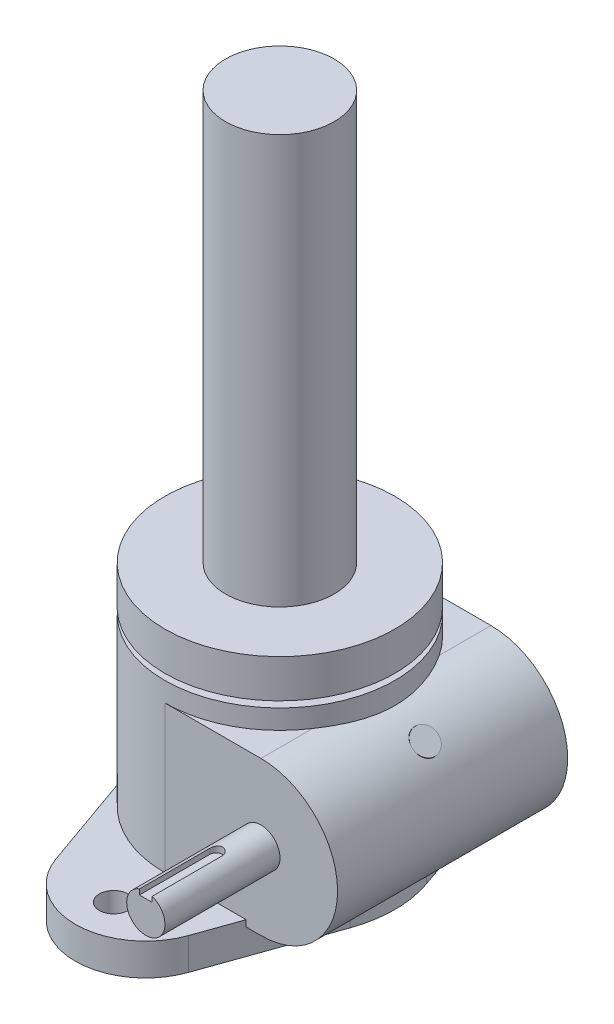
from build123d import *

# Parameters (mm, degrees)
BOSS_EXTRUDE2_DEPTH      = 28.575
BOSS_EXTRUDE2_DEPTH_BACK = 28.575
SKETCH3_W                = 85.7504
SKETCH3_H                = 4.7498
CUT_KEYWAY1_DEPTH        = 0.00254
BOSS_EXTRUDE3_START      = 7.9375
SKETCH5_R                = 3.571875
BOSS_EXTRUDE3_DEPTH      = 7.9375
CUT_KEYWAY2_REACH        = 153.305
CUT_KEYWAY2_END_RADIUS   = 4.7498


with BuildPart() as part:
    # Sketch1 → Base-Revolve (revolve)
    with BuildSketch(Plane.XY, mode=Mode.PRIVATE) as base_revolve_sk:
        Polygon((0, -9.525), (-14.2875, -9.525), (-14.2875, 0), (-28.575, 0), (-28.575, 49.276), (-22.987, 49.276), (-22.987, 50.8), (-28.575, 50.8), (-28.575, 60.325), (-13.49375, 60.325), (-13.49375, 161.925), (0, 161.925), align=None)
    revolve(base_revolve_sk.sketch.rotate(Axis((0, 0, 0), (0, 1, 0)), 270), axis=Axis((0, 0, 0), (0, 1, 0)))

    # Sketch2 → Boss-Extrude2 (add, two sides: drawn at the far end of the back side and taken through both)
    with BuildSketch(Plane.XY.offset(-BOSS_EXTRUDE2_DEPTH_BACK)):
        with BuildLine():
            Line((23.8633, 6.35), (0, 6.35))
            Line((0, 6.35), (0, 44.45))
            Line((0, 44.45), (23.8633, 44.45))
            ThreePointArc((23.8633, 44.45), (42.9133, 25.4), (23.8633, 6.35))
        make_face()
    extrude(amount=BOSS_EXTRUDE2_DEPTH + BOSS_EXTRUDE2_DEPTH_BACK)

    # Sketch3 → Boss-Revolve1 (revolve)
    with BuildSketch(Plane.ZY.offset(-23.8633), mode=Mode.PRIVATE) as boss_revolve1_sk:
        with Locations((14.2748, 23.0251)):
            Rectangle(SKETCH3_W, SKETCH3_H)
    revolve(boss_revolve1_sk.sketch.rotate(Axis((23.8633, 25.4, -105.895333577), (0, 0, 1)), 270), axis=Axis((23.8633, 25.4, -105.895333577), (0, 0, 1)))

    # Sketch8 → Cut-Keyway1 (cut)
    with BuildSketch(Plane(origin=(0, 28.5623, 0), x_dir=(-1, 0, 0), z_dir=(0, 1, 0))):
        with BuildLine():
            Line((-25.4508, -28.6004), (-22.2758, -28.6004))
            Line((-22.2758, -28.6004), (-22.2758, -11.1379))
            ThreePointArc((-22.2758, -11.1379), (-23.8633, -9.5504), (-25.4508, -11.1379))
            Line((-25.4508, -11.1379), (-25.4508, -28.6004))
        make_face()
    extrude(amount=CUT_KEYWAY1_DEPTH, mode=Mode.SUBTRACT)

    # Sketch5 → Boss-Extrude3 (add)
    with BuildSketch(Plane(origin=(0, 0, 0), x_dir=(-1, 0, 0), z_dir=(0, 1, 0)).offset(BOSS_EXTRUDE3_START)):
        with BuildLine():
            Line((26.940768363, 9.525), (16.463802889, 39.158333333))
            ThreePointArc((16.463802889, 39.158333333), (0, 50.8), (-16.463802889, 39.158333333))
            Line((-16.463802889, 39.158333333), (-26.940768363, 9.525))
            ThreePointArc((-26.940768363, 9.525), (-28.575, 0), (-26.940768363, -9.525))
            Line((-26.940768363, -9.525), (-16.463802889, -39.158333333))
            ThreePointArc((-16.463802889, -39.158333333), (0, -50.8), (16.463802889, -39.158333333))
            Line((16.463802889, -39.158333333), (26.940768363, -9.525))
            ThreePointArc((26.940768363, -9.525), (28.575, 0), (26.940768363, 9.525))
        make_face()
        with Locations(Location((0, -41.275, 0), (0, 0, 90))):
            Circle(SKETCH5_R, mode=Mode.SUBTRACT)
        with Locations(Location((0, 41.275, 0), (0, 0, 90))):
            Circle(SKETCH5_R, mode=Mode.SUBTRACT)
    extrude(amount=-BOSS_EXTRUDE3_DEPTH)

    # Sketch6 → Cut-Revolve1 (revolve, cut)
    with BuildSketch(Plane.XY, mode=Mode.PRIVATE) as cut_revolve1_sk:
        Polygon((0, 159.385), (0, -28.575), (-7.9375, -28.575), (-7.9375, 9.525), (-10.95375, 9.525), (-10.95375, 60.325), (-10.95375, 159.385), align=None)
    revolve(cut_revolve1_sk.sketch.rotate(Axis((0, 0, 0), (0, 1, 0)), 270), axis=Axis((0, 0, 0), (0, 1, 0)), mode=Mode.SUBTRACT)

    # Sketch7 → Boss-Revolve2 (revolve)
    with BuildSketch(Plane.XY):
        Polygon((34.067553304, 37.560955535), (36.499744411, 35.520104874), (38.540595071, 37.952295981), (36.108403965, 39.993146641), align=None)
    revolve(axis=Axis((23.8633, 25.4, 0), (0.6427876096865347, 0.7660444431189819, 0)))

    # Cut-Keyway2: up to this cylinder (the profile starts inside it)
    cut_keyway2_end = Plane(origin=(23.8633, 25.4, 47.791985), z_dir=(0, 0, -1)) * Cylinder(CUT_KEYWAY2_END_RADIUS, 317.1096, mode=Mode.PRIVATE)
    # Sketch10 → Cut-Keyway2 (cut, up to the surface)
    with BuildSketch(Plane(origin=(0, 28.5623, 0), x_dir=(-1, 0, 0), z_dir=(0, 1, 0)), mode=Mode.PRIVATE) as cut_keyway2_sk1:
        with BuildLine():
            Line((-22.2758, 57.15), (-25.4508, 57.15))
            Line((-25.4508, 57.15), (-25.4508, 39.6875))
            ThreePointArc((-25.4508, 39.6875), (-23.8633, 38.1), (-22.2758, 39.6875))
            Line((-22.2758, 39.6875), (-22.2758, 57.15))
        make_face()
    cut_keyway2_tool1 = extrude(cut_keyway2_sk1.sketch, amount=CUT_KEYWAY2_REACH, mode=Mode.PRIVATE) & cut_keyway2_end
    add(cut_keyway2_tool1.solids().sort_by_distance((23.8633, 28.5623, 47.791985))[0], mode=Mode.SUBTRACT)


solid = part.part
